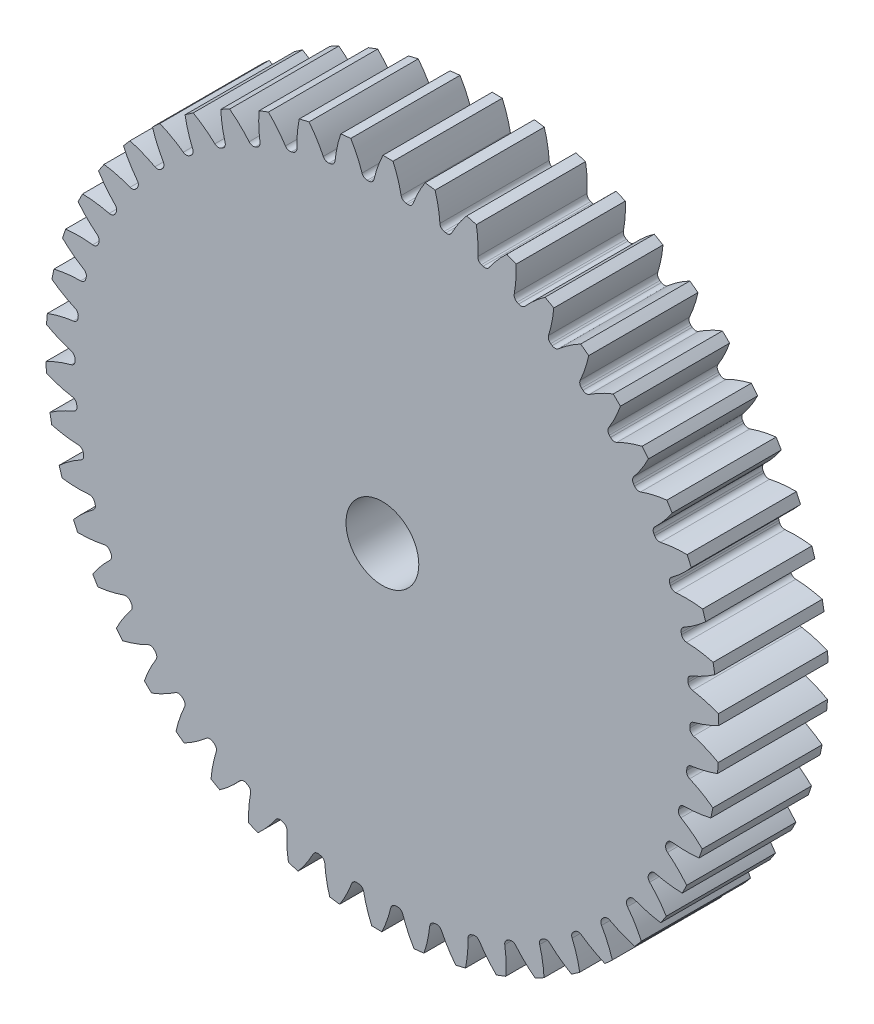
from build123d import *

# Parameters (mm, degrees)
SKETCH3_R         = 293.511111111
GEARBODY_DEPTH    = 95.25
TOOTHCUT_DEPTH    = 426.87569453
CIRPATTERN1_COUNT = 50
BOREDIA_R         = 31.75
BORE_DEPTH        = 12700


with BuildPart() as part:
    # Sketch3 → gearBody (new body)
    with BuildSketch(Plane.XY):
        Circle(SKETCH3_R)
    extrude(amount=GEARBODY_DEPTH)

    # Sketch2 → toothCut (cut, through all)
    with BuildSketch(Plane.XY):
        with BuildLine():
            ThreePointArc((268.0596867, -5.250930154), (268.073905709, -4.466428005), (268.085828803, -3.681887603))
            ThreePointArc((268.085828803, -3.681887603), (269.060815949, -0.914463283), (271.511784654, 0.698605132))
            ThreePointArc((271.511784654, 0.698605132), (282.754172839, 4.347194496), (293.511111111, 9.245334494))
            ThreePointArc((293.511111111, 9.245334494), (293.615934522, -4.891988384), (293.040211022, -19.017972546))
            ThreePointArc((293.040211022, -19.017972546), (282.45241554, -13.764204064), (271.337813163, -9.743120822))
            ThreePointArc((271.337813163, -9.743120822), (268.941941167, -8.049298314), (268.0596867, -5.250930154))
        make_face()
    toothcut = extrude(amount=TOOTHCUT_DEPTH, mode=Mode.SUBTRACT)

    # CirPattern1: toothCut ×50 about axis
    cirpattern1_axis = Axis((0, 0, 0), (0, 0, 1))
    for i in range(1, CIRPATTERN1_COUNT):
        add(toothcut.rotate(cirpattern1_axis, i * 360 / CIRPATTERN1_COUNT), mode=Mode.SUBTRACT)

    # boreDia → bore (cut, symmetric)
    with BuildSketch(Plane.XY):
        Circle(BOREDIA_R)
    extrude(amount=BORE_DEPTH, both=True, mode=Mode.SUBTRACT)


solid = part.part
